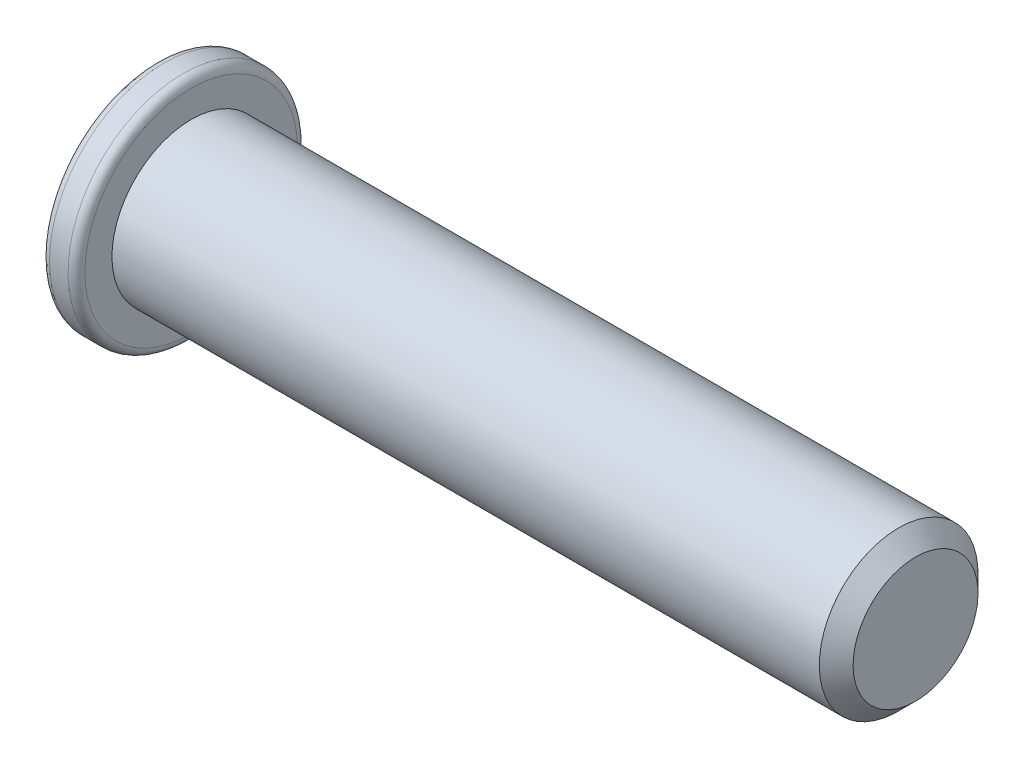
from build123d import *

# Parameters (mm, degrees)
CHAMFER1_SIZE = 1
FILLET1_R     = 0.5


with BuildPart() as part:
    # Sketch1 → Revolve1 (revolve)
    with BuildSketch(Plane.XY):
        Polygon((0, 0), (0, 6.8), (2.1, 6.8), (2.1, 4.7), (45, 4.7), (45, 0), align=None)
    revolve(axis=Axis((45, 0, 0), (-1, 0, 0)))

    # Chamfer1
    chamfer1_edges = [part.edges().sort_by_distance(p)[0] for p in [
        (45, -4.7, 0),
    ]]
    chamfer(chamfer1_edges, length=CHAMFER1_SIZE)

    # Fillet1
    fillet1_edges = [part.edges().sort_by_distance(p)[0] for p in [
        (2.1, -6.8, 0),
        (0, -6.8, 0),
    ]]
    fillet(fillet1_edges, radius=FILLET1_R)


solid = part.part
